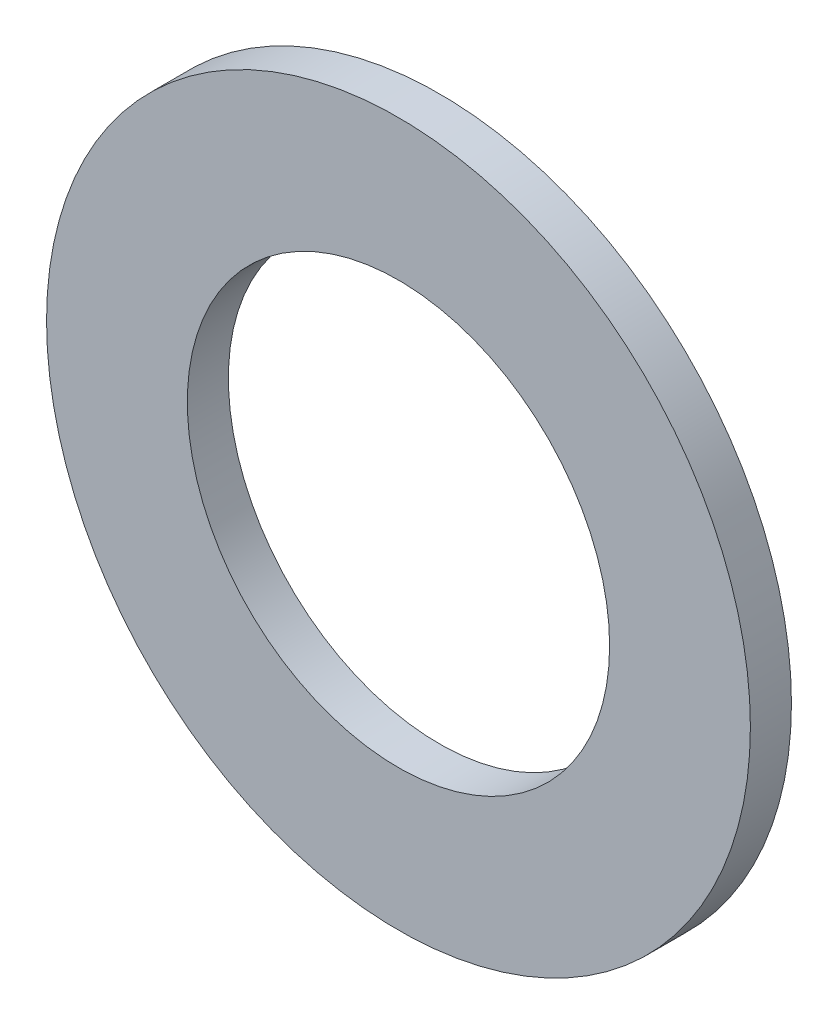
ISO-10303-21;
HEADER;
FILE_DESCRIPTION(('STEP AP214'),'2;1');
FILE_NAME('part.step','',(''),(''),'','','');
FILE_SCHEMA(('AUTOMOTIVE_DESIGN { 1 0 10303 214 1 1 1 1 }'));
ENDSEC;
DATA;
#1=APPLICATION_CONTEXT('core data for automotive mechanical design processes');
#2=APPLICATION_PROTOCOL_DEFINITION('international standard','automotive_design',2000,#1);
#3=PRODUCT_CONTEXT('',#1,'mechanical');
#4=PRODUCT('Part','Part','',(#3));
#5=PRODUCT_RELATED_PRODUCT_CATEGORY('part','',(#4));
#6=PRODUCT_DEFINITION_FORMATION('','',#4);
#7=PRODUCT_DEFINITION_CONTEXT('part definition',#1,'design');
#8=PRODUCT_DEFINITION('design','',#6,#7);
#9=PRODUCT_DEFINITION_SHAPE('','',#8);
#10=(LENGTH_UNIT() NAMED_UNIT(*) SI_UNIT(.MILLI.,.METRE.));
#11=(NAMED_UNIT(*) PLANE_ANGLE_UNIT() SI_UNIT($,.RADIAN.));
#12=(NAMED_UNIT(*) SI_UNIT($,.STERADIAN.) SOLID_ANGLE_UNIT());
#13=UNCERTAINTY_MEASURE_WITH_UNIT(LENGTH_MEASURE(1.E-05),#10,'distance_accuracy_value','');
#14=(GEOMETRIC_REPRESENTATION_CONTEXT(3) GLOBAL_UNCERTAINTY_ASSIGNED_CONTEXT((#13)) GLOBAL_UNIT_ASSIGNED_CONTEXT((#10,
#11,#12)) REPRESENTATION_CONTEXT('',''));
#15=CARTESIAN_POINT('',(0.,0.,0.));
#16=DIRECTION('',(0.,0.,1.));
#17=DIRECTION('',(1.,0.,0.));
#18=AXIS2_PLACEMENT_3D('',#15,#16,#17);
#19=CARTESIAN_POINT('',(0.,0.,0.35));
#20=DIRECTION('',(0.,0.,1.));
#21=DIRECTION('',(1.,0.,0.));
#22=AXIS2_PLACEMENT_3D('',#19,#20,#21);
#23=PLANE('',#22);
#24=CARTESIAN_POINT('',(0.,0.,0.35));
#25=DIRECTION('',(0.,0.,1.));
#26=DIRECTION('',(1.,0.,0.));
#27=AXIS2_PLACEMENT_3D('',#24,#25,#26);
#28=CIRCLE('',#27,6.);
#29=CARTESIAN_POINT('',(6.,0.,0.35));
#30=VERTEX_POINT('',#29);
#31=EDGE_CURVE('E10',#30,#30,#28,.T.);
#32=ORIENTED_EDGE('',*,*,#31,.T.);
#33=EDGE_LOOP('',(#32));
#34=FACE_BOUND('',#33,.T.);
#35=CARTESIAN_POINT('',(0.,0.,0.35));
#36=DIRECTION('',(0.,0.,1.));
#37=DIRECTION('',(1.,0.,0.));
#38=AXIS2_PLACEMENT_3D('',#35,#36,#37);
#39=CIRCLE('',#38,3.6);
#40=CARTESIAN_POINT('',(3.6,0.,0.35));
#41=VERTEX_POINT('',#40);
#42=EDGE_CURVE('E33',#41,#41,#39,.T.);
#43=ORIENTED_EDGE('',*,*,#42,.F.);
#44=EDGE_LOOP('',(#43));
#45=FACE_BOUND('',#44,.T.);
#46=ADVANCED_FACE('F22',(#34,#45),#23,.T.);
#47=CARTESIAN_POINT('',(0.,0.,-0.35));
#48=DIRECTION('',(0.,0.,1.));
#49=DIRECTION('',(1.,0.,0.));
#50=AXIS2_PLACEMENT_3D('',#47,#48,#49);
#51=PLANE('',#50);
#52=CARTESIAN_POINT('',(0.,0.,-0.35));
#53=DIRECTION('',(0.,0.,1.));
#54=DIRECTION('',(1.,0.,0.));
#55=AXIS2_PLACEMENT_3D('',#52,#53,#54);
#56=CIRCLE('',#55,6.);
#57=CARTESIAN_POINT('',(6.,0.,-0.35));
#58=VERTEX_POINT('',#57);
#59=EDGE_CURVE('E29',#58,#58,#56,.T.);
#60=ORIENTED_EDGE('',*,*,#59,.F.);
#61=EDGE_LOOP('',(#60));
#62=FACE_BOUND('',#61,.T.);
#63=CARTESIAN_POINT('',(0.,0.,-0.35));
#64=DIRECTION('',(0.,0.,1.));
#65=DIRECTION('',(1.,0.,0.));
#66=AXIS2_PLACEMENT_3D('',#63,#64,#65);
#67=CIRCLE('',#66,3.6);
#68=CARTESIAN_POINT('',(3.6,0.,-0.35));
#69=VERTEX_POINT('',#68);
#70=EDGE_CURVE('E37',#69,#69,#67,.T.);
#71=ORIENTED_EDGE('',*,*,#70,.T.);
#72=EDGE_LOOP('',(#71));
#73=FACE_BOUND('',#72,.T.);
#74=ADVANCED_FACE('F43',(#62,#73),#51,.F.);
#75=CARTESIAN_POINT('',(0.,0.,0.35));
#76=DIRECTION('',(0.,0.,-1.));
#77=DIRECTION('',(-1.,0.,0.));
#78=AXIS2_PLACEMENT_3D('',#75,#76,#77);
#79=CYLINDRICAL_SURFACE('',#78,6.);
#80=ORIENTED_EDGE('',*,*,#31,.F.);
#81=EDGE_LOOP('',(#80));
#82=FACE_BOUND('',#81,.T.);
#83=ORIENTED_EDGE('',*,*,#59,.T.);
#84=EDGE_LOOP('',(#83));
#85=FACE_BOUND('',#84,.T.);
#86=ADVANCED_FACE('F24',(#82,#85),#79,.T.);
#87=CARTESIAN_POINT('',(0.,0.,0.35));
#88=DIRECTION('',(0.,0.,-1.));
#89=DIRECTION('',(-1.,0.,0.));
#90=AXIS2_PLACEMENT_3D('',#87,#88,#89);
#91=CYLINDRICAL_SURFACE('',#90,3.6);
#92=ORIENTED_EDGE('',*,*,#42,.T.);
#93=EDGE_LOOP('',(#92));
#94=FACE_BOUND('',#93,.T.);
#95=ORIENTED_EDGE('',*,*,#70,.F.);
#96=EDGE_LOOP('',(#95));
#97=FACE_BOUND('',#96,.T.);
#98=ADVANCED_FACE('F45',(#94,#97),#91,.F.);
#99=CLOSED_SHELL('',(#46,#74,#86,#98));
#100=MANIFOLD_SOLID_BREP('B2',#99);
#101=ADVANCED_BREP_SHAPE_REPRESENTATION('',(#18,#100),#14);
#102=SHAPE_DEFINITION_REPRESENTATION(#9,#101);
ENDSEC;
END-ISO-10303-21;
